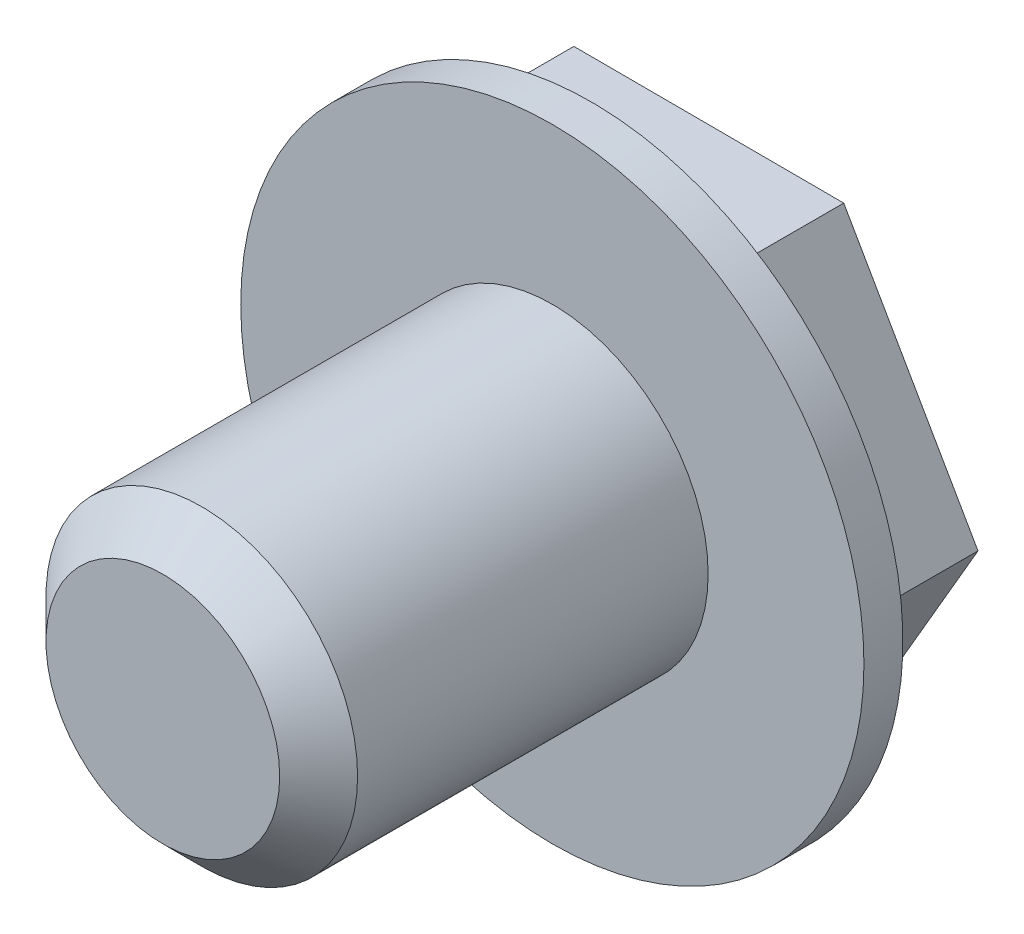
from build123d import *

# Parameters (mm, degrees)
ESQUISSE1_R             = 4
BOSS_EXTRU_1_DEPTH      = 7
ESQUISSE2_OUTSIDE_W     = 12.66
ESQUISSE2_OUTSIDE_H     = 12.66
ESQUISSE2_OUTSIDE_R     = 2
ENL_V_MAT_EXTRU_1_DEPTH = 5
CHANFREIN1_SIZE         = 0.5
ESQUISSE3_OUTSIDE_W     = 12.66
ESQUISSE3_OUTSIDE_H     = 12.66
ENL_V_MAT_EXTRU_2_DEPTH = 1.5
ESQUISSE4_W             = 1
ESQUISSE4_H             = 4
ESQUISSE4_W_2           = 4
ESQUISSE4_H_2           = 1
ENL_V_MAT_EXTRU_3_DEPTH = 1


with BuildPart() as part:
    # Esquisse1 → Boss.-Extru.1 (new body)
    with BuildSketch(Plane.XY):
        Circle(ESQUISSE1_R)
    extrude(amount=BOSS_EXTRU_1_DEPTH)

    # Esquisse2 outside → Enl_v. mat.-Extru.1 (cut)
    with BuildSketch(Plane.XY.offset(7)):
        Rectangle(ESQUISSE2_OUTSIDE_W, ESQUISSE2_OUTSIDE_H)
        Circle(ESQUISSE2_OUTSIDE_R, mode=Mode.SUBTRACT)
    extrude(amount=-ENL_V_MAT_EXTRU_1_DEPTH, mode=Mode.SUBTRACT)

    # Chanfrein1
    chanfrein1_edges = [part.edges().sort_by_distance(p)[0] for p in [
        (-2, 0, 7),
    ]]
    chamfer(chanfrein1_edges, length=CHANFREIN1_SIZE)

    # Esquisse3 outside → Enl_v. mat.-Extru.2 (cut)
    with BuildSketch(Plane(origin=(0, 0, 0), x_dir=(-1, 0, 0), z_dir=(0, 0, -1))):
        Rectangle(ESQUISSE3_OUTSIDE_W, ESQUISSE3_OUTSIDE_H)
        Polygon((1.740683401, -2.994999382), (3.46408725, 0.009976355), (1.723403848, 3.004975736), (-1.740683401, 2.994999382), (-3.46408725, -0.009976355), (-1.723403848, -3.004975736), align=None, mode=Mode.SUBTRACT)
    extrude(amount=-ENL_V_MAT_EXTRU_2_DEPTH, mode=Mode.SUBTRACT)

    # Esquisse4 → Enl_v. mat.-Extru.3 (cut)
    with BuildSketch(Plane(origin=(0, 0, 0), x_dir=(-1, 0, 0), z_dir=(0, 0, -1))):
        Rectangle(ESQUISSE4_W, ESQUISSE4_H)
        Rectangle(ESQUISSE4_W_2, ESQUISSE4_H_2)
    extrude(amount=-ENL_V_MAT_EXTRU_3_DEPTH, mode=Mode.SUBTRACT)


solid = part.part
